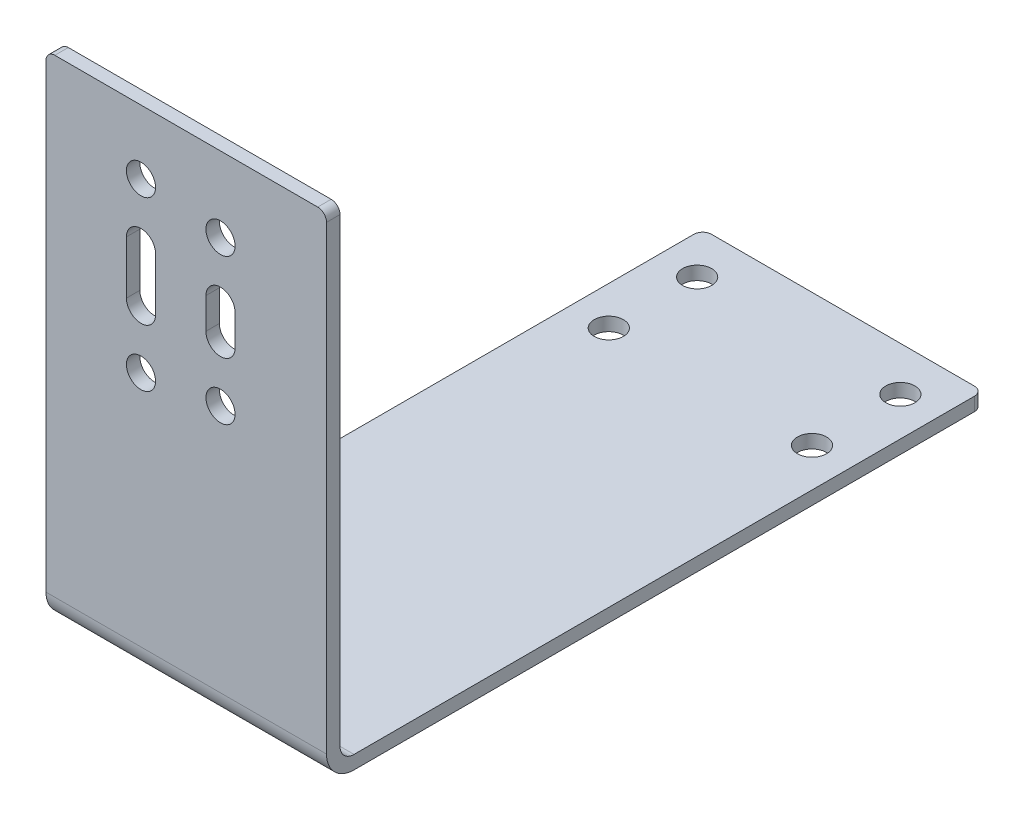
ISO-10303-21;
HEADER;
FILE_DESCRIPTION(('STEP AP214'),'2;1');
FILE_NAME('part.step','',(''),(''),'','','');
FILE_SCHEMA(('AUTOMOTIVE_DESIGN { 1 0 10303 214 1 1 1 1 }'));
ENDSEC;
DATA;
#1=APPLICATION_CONTEXT('core data for automotive mechanical design processes');
#2=APPLICATION_PROTOCOL_DEFINITION('international standard','automotive_design',2000,#1);
#3=PRODUCT_CONTEXT('',#1,'mechanical');
#4=PRODUCT('Part','Part','',(#3));
#5=PRODUCT_RELATED_PRODUCT_CATEGORY('part','',(#4));
#6=PRODUCT_DEFINITION_FORMATION('','',#4);
#7=PRODUCT_DEFINITION_CONTEXT('part definition',#1,'design');
#8=PRODUCT_DEFINITION('design','',#6,#7);
#9=PRODUCT_DEFINITION_SHAPE('','',#8);
#10=(LENGTH_UNIT() NAMED_UNIT(*) SI_UNIT(.MILLI.,.METRE.));
#11=(NAMED_UNIT(*) PLANE_ANGLE_UNIT() SI_UNIT($,.RADIAN.));
#12=(NAMED_UNIT(*) SI_UNIT($,.STERADIAN.) SOLID_ANGLE_UNIT());
#13=UNCERTAINTY_MEASURE_WITH_UNIT(LENGTH_MEASURE(1.E-05),#10,'distance_accuracy_value','');
#14=(GEOMETRIC_REPRESENTATION_CONTEXT(3) GLOBAL_UNCERTAINTY_ASSIGNED_CONTEXT((#13)) GLOBAL_UNIT_ASSIGNED_CONTEXT((#10,
#11,#12)) REPRESENTATION_CONTEXT('',''));
#15=CARTESIAN_POINT('',(0.,0.,0.));
#16=DIRECTION('',(0.,0.,1.));
#17=DIRECTION('',(1.,0.,0.));
#18=AXIS2_PLACEMENT_3D('',#15,#16,#17);
#19=CARTESIAN_POINT('',(0.,3.048,-122.42));
#20=DIRECTION('',(0.,-1.,0.));
#21=DIRECTION('',(0.,0.,-1.));
#22=AXIS2_PLACEMENT_3D('',#19,#20,#21);
#23=PLANE('',#22);
#24=CARTESIAN_POINT('',(54.75,3.048,-112.42));
#25=DIRECTION('',(0.,1.,0.));
#26=DIRECTION('',(0.,0.,1.));
#27=AXIS2_PLACEMENT_3D('',#24,#25,#26);
#28=CIRCLE('',#27,3.3);
#29=CARTESIAN_POINT('',(54.75,3.048,-109.12));
#30=VERTEX_POINT('',#29);
#31=EDGE_CURVE('E399',#30,#30,#28,.T.);
#32=ORIENTED_EDGE('',*,*,#31,.F.);
#33=EDGE_LOOP('',(#32));
#34=FACE_BOUND('',#33,.T.);
#35=CARTESIAN_POINT('',(8.75,3.048,-112.42));
#36=DIRECTION('',(0.,1.,0.));
#37=DIRECTION('',(0.,0.,1.));
#38=AXIS2_PLACEMENT_3D('',#35,#36,#37);
#39=CIRCLE('',#38,3.3);
#40=CARTESIAN_POINT('',(8.75,3.048,-109.12));
#41=VERTEX_POINT('',#40);
#42=EDGE_CURVE('E393',#41,#41,#39,.T.);
#43=ORIENTED_EDGE('',*,*,#42,.F.);
#44=EDGE_LOOP('',(#43));
#45=FACE_BOUND('',#44,.T.);
#46=CARTESIAN_POINT('',(54.75,3.048,-132.42));
#47=DIRECTION('',(0.,1.,0.));
#48=DIRECTION('',(0.,0.,1.));
#49=AXIS2_PLACEMENT_3D('',#46,#47,#48);
#50=CIRCLE('',#49,3.3);
#51=CARTESIAN_POINT('',(54.75,3.048,-129.12));
#52=VERTEX_POINT('',#51);
#53=EDGE_CURVE('E313',#52,#52,#50,.T.);
#54=ORIENTED_EDGE('',*,*,#53,.F.);
#55=EDGE_LOOP('',(#54));
#56=FACE_BOUND('',#55,.T.);
#57=CARTESIAN_POINT('',(8.75,3.048,-132.42));
#58=DIRECTION('',(0.,1.,0.));
#59=DIRECTION('',(0.,0.,1.));
#60=AXIS2_PLACEMENT_3D('',#57,#58,#59);
#61=CIRCLE('',#60,3.3);
#62=CARTESIAN_POINT('',(8.75,3.048,-129.12));
#63=VERTEX_POINT('',#62);
#64=EDGE_CURVE('E304',#63,#63,#61,.T.);
#65=ORIENTED_EDGE('',*,*,#64,.F.);
#66=EDGE_LOOP('',(#65));
#67=FACE_BOUND('',#66,.T.);
#68=DIRECTION('',(1.,0.,0.));
#69=VECTOR('',#68,1.);
#70=CARTESIAN_POINT('',(0.,3.048,0.));
#71=LINE('',#70,#69);
#72=CARTESIAN_POINT('',(0.,3.048,0.));
#73=VERTEX_POINT('',#72);
#74=CARTESIAN_POINT('',(63.5,3.048,0.));
#75=VERTEX_POINT('',#74);
#76=EDGE_CURVE('E216',#73,#75,#71,.T.);
#77=ORIENTED_EDGE('',*,*,#76,.T.);
#78=DIRECTION('',(0.,0.,-1.));
#79=VECTOR('',#78,1.);
#80=CARTESIAN_POINT('',(63.5,3.048,-122.42));
#81=LINE('',#80,#79);
#82=CARTESIAN_POINT('',(63.5,3.048,-140.42));
#83=VERTEX_POINT('',#82);
#84=EDGE_CURVE('E197',#75,#83,#81,.T.);
#85=ORIENTED_EDGE('',*,*,#84,.T.);
#86=CARTESIAN_POINT('',(61.5,3.048,-140.42));
#87=DIRECTION('',(0.,-1.,0.));
#88=DIRECTION('',(0.,0.,-1.));
#89=AXIS2_PLACEMENT_3D('',#86,#87,#88);
#90=CIRCLE('',#89,2.);
#91=CARTESIAN_POINT('',(61.5,3.048,-142.42));
#92=VERTEX_POINT('',#91);
#93=EDGE_CURVE('E275',#83,#92,#90,.F.);
#94=ORIENTED_EDGE('',*,*,#93,.T.);
#95=DIRECTION('',(-1.,0.,0.));
#96=VECTOR('',#95,1.);
#97=CARTESIAN_POINT('',(0.,3.048,-142.42));
#98=LINE('',#97,#96);
#99=CARTESIAN_POINT('',(2.,3.048,-142.42));
#100=VERTEX_POINT('',#99);
#101=EDGE_CURVE('E225',#92,#100,#98,.T.);
#102=ORIENTED_EDGE('',*,*,#101,.T.);
#103=CARTESIAN_POINT('',(2.,3.048,-140.42));
#104=DIRECTION('',(0.,-1.,0.));
#105=DIRECTION('',(0.,0.,-1.));
#106=AXIS2_PLACEMENT_3D('',#103,#104,#105);
#107=CIRCLE('',#106,2.);
#108=CARTESIAN_POINT('',(0.,3.048,-140.42));
#109=VERTEX_POINT('',#108);
#110=EDGE_CURVE('E254',#100,#109,#107,.F.);
#111=ORIENTED_EDGE('',*,*,#110,.T.);
#112=DIRECTION('',(0.,0.,1.));
#113=VECTOR('',#112,1.);
#114=CARTESIAN_POINT('',(0.,3.048,0.));
#115=LINE('',#114,#113);
#116=EDGE_CURVE('E223',#109,#73,#115,.T.);
#117=ORIENTED_EDGE('',*,*,#116,.T.);
#118=EDGE_LOOP('',(#77,#85,#94,#102,#111,#117));
#119=FACE_BOUND('',#118,.T.);
#120=ADVANCED_FACE('F62',(#34,#45,#56,#67,#119),#23,.F.);
#121=CARTESIAN_POINT('',(0.,0.,-122.42));
#122=DIRECTION('',(0.,-1.,0.));
#123=DIRECTION('',(0.,0.,-1.));
#124=AXIS2_PLACEMENT_3D('',#121,#122,#123);
#125=PLANE('',#124);
#126=CARTESIAN_POINT('',(54.75,0.,-112.42));
#127=DIRECTION('',(0.,-1.,0.));
#128=DIRECTION('',(0.,0.,-1.));
#129=AXIS2_PLACEMENT_3D('',#126,#127,#128);
#130=CIRCLE('',#129,3.3);
#131=CARTESIAN_POINT('',(54.75,0.,-115.72));
#132=VERTEX_POINT('',#131);
#133=EDGE_CURVE('E402',#132,#132,#130,.T.);
#134=ORIENTED_EDGE('',*,*,#133,.F.);
#135=EDGE_LOOP('',(#134));
#136=FACE_BOUND('',#135,.T.);
#137=CARTESIAN_POINT('',(8.75,0.,-112.42));
#138=DIRECTION('',(0.,-1.,0.));
#139=DIRECTION('',(0.,0.,-1.));
#140=AXIS2_PLACEMENT_3D('',#137,#138,#139);
#141=CIRCLE('',#140,3.3);
#142=CARTESIAN_POINT('',(8.75,0.,-115.72));
#143=VERTEX_POINT('',#142);
#144=EDGE_CURVE('E396',#143,#143,#141,.T.);
#145=ORIENTED_EDGE('',*,*,#144,.F.);
#146=EDGE_LOOP('',(#145));
#147=FACE_BOUND('',#146,.T.);
#148=CARTESIAN_POINT('',(54.75,0.,-132.42));
#149=DIRECTION('',(0.,-1.,0.));
#150=DIRECTION('',(0.,0.,-1.));
#151=AXIS2_PLACEMENT_3D('',#148,#149,#150);
#152=CIRCLE('',#151,3.3);
#153=CARTESIAN_POINT('',(54.75,0.,-135.72));
#154=VERTEX_POINT('',#153);
#155=EDGE_CURVE('E316',#154,#154,#152,.T.);
#156=ORIENTED_EDGE('',*,*,#155,.F.);
#157=EDGE_LOOP('',(#156));
#158=FACE_BOUND('',#157,.T.);
#159=CARTESIAN_POINT('',(8.75,0.,-132.42));
#160=DIRECTION('',(0.,-1.,0.));
#161=DIRECTION('',(0.,0.,-1.));
#162=AXIS2_PLACEMENT_3D('',#159,#160,#161);
#163=CIRCLE('',#162,3.3);
#164=CARTESIAN_POINT('',(8.75,0.,-135.72));
#165=VERTEX_POINT('',#164);
#166=EDGE_CURVE('E310',#165,#165,#163,.T.);
#167=ORIENTED_EDGE('',*,*,#166,.F.);
#168=EDGE_LOOP('',(#167));
#169=FACE_BOUND('',#168,.T.);
#170=DIRECTION('',(0.,0.,-1.));
#171=VECTOR('',#170,1.);
#172=CARTESIAN_POINT('',(63.5,0.,-122.42));
#173=LINE('',#172,#171);
#174=CARTESIAN_POINT('',(63.5,0.,0.));
#175=VERTEX_POINT('',#174);
#176=CARTESIAN_POINT('',(63.5,0.,-140.42));
#177=VERTEX_POINT('',#176);
#178=EDGE_CURVE('E210',#175,#177,#173,.T.);
#179=ORIENTED_EDGE('',*,*,#178,.F.);
#180=DIRECTION('',(1.,0.,0.));
#181=VECTOR('',#180,1.);
#182=CARTESIAN_POINT('',(0.,0.,0.));
#183=LINE('',#182,#181);
#184=CARTESIAN_POINT('',(0.,0.,0.));
#185=VERTEX_POINT('',#184);
#186=EDGE_CURVE('E236',#185,#175,#183,.T.);
#187=ORIENTED_EDGE('',*,*,#186,.F.);
#188=DIRECTION('',(0.,0.,1.));
#189=VECTOR('',#188,1.);
#190=CARTESIAN_POINT('',(0.,0.,0.));
#191=LINE('',#190,#189);
#192=CARTESIAN_POINT('',(0.,0.,-140.42));
#193=VERTEX_POINT('',#192);
#194=EDGE_CURVE('E234',#193,#185,#191,.T.);
#195=ORIENTED_EDGE('',*,*,#194,.F.);
#196=CARTESIAN_POINT('',(2.,0.,-140.42));
#197=DIRECTION('',(0.,-1.,0.));
#198=DIRECTION('',(0.,0.,-1.));
#199=AXIS2_PLACEMENT_3D('',#196,#197,#198);
#200=CIRCLE('',#199,2.);
#201=CARTESIAN_POINT('',(2.,0.,-142.42));
#202=VERTEX_POINT('',#201);
#203=EDGE_CURVE('E279',#193,#202,#200,.T.);
#204=ORIENTED_EDGE('',*,*,#203,.T.);
#205=DIRECTION('',(-1.,0.,0.));
#206=VECTOR('',#205,1.);
#207=CARTESIAN_POINT('',(0.,0.,-142.42));
#208=LINE('',#207,#206);
#209=CARTESIAN_POINT('',(61.5,0.,-142.42));
#210=VERTEX_POINT('',#209);
#211=EDGE_CURVE('E230',#210,#202,#208,.T.);
#212=ORIENTED_EDGE('',*,*,#211,.F.);
#213=CARTESIAN_POINT('',(61.5,0.,-140.42));
#214=DIRECTION('',(0.,-1.,0.));
#215=DIRECTION('',(0.,0.,-1.));
#216=AXIS2_PLACEMENT_3D('',#213,#214,#215);
#217=CIRCLE('',#216,2.);
#218=EDGE_CURVE('E283',#210,#177,#217,.T.);
#219=ORIENTED_EDGE('',*,*,#218,.T.);
#220=EDGE_LOOP('',(#179,#187,#195,#204,#212,#219));
#221=FACE_BOUND('',#220,.T.);
#222=ADVANCED_FACE('F427',(#136,#147,#158,#169,#221),#125,.T.);
#223=CARTESIAN_POINT('',(63.5,6.22299999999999,0.));
#224=DIRECTION('',(1.,0.,0.));
#225=DIRECTION('',(0.,0.,1.));
#226=AXIS2_PLACEMENT_3D('',#223,#224,#225);
#227=CYLINDRICAL_SURFACE('',#226,6.22299999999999);
#228=ORIENTED_EDGE('',*,*,#186,.T.);
#229=CARTESIAN_POINT('',(63.5,6.22299999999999,0.));
#230=DIRECTION('',(1.,0.,0.));
#231=DIRECTION('',(0.,0.,-1.));
#232=AXIS2_PLACEMENT_3D('',#229,#230,#231);
#233=CIRCLE('',#232,6.22299999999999);
#234=CARTESIAN_POINT('',(63.5,6.22299999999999,6.22299999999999));
#235=VERTEX_POINT('',#234);
#236=EDGE_CURVE('E302',#175,#235,#233,.F.);
#237=ORIENTED_EDGE('',*,*,#236,.T.);
#238=DIRECTION('',(1.,0.,0.));
#239=VECTOR('',#238,1.);
#240=CARTESIAN_POINT('',(0.,6.22299999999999,6.22299999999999));
#241=LINE('',#240,#239);
#242=CARTESIAN_POINT('',(0.,6.22299999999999,6.22299999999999));
#243=VERTEX_POINT('',#242);
#244=EDGE_CURVE('E301',#235,#243,#241,.F.);
#245=ORIENTED_EDGE('',*,*,#244,.T.);
#246=CARTESIAN_POINT('',(0.,6.22299999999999,0.));
#247=DIRECTION('',(1.,0.,0.));
#248=DIRECTION('',(0.,0.,-1.));
#249=AXIS2_PLACEMENT_3D('',#246,#247,#248);
#250=CIRCLE('',#249,6.22299999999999);
#251=EDGE_CURVE('E237',#185,#243,#250,.F.);
#252=ORIENTED_EDGE('',*,*,#251,.F.);
#253=EDGE_LOOP('',(#228,#237,#245,#252));
#254=FACE_BOUND('',#253,.T.);
#255=ADVANCED_FACE('F433',(#254),#227,.T.);
#256=CARTESIAN_POINT('',(63.5,6.22299999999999,0.));
#257=DIRECTION('',(1.,0.,0.));
#258=DIRECTION('',(0.,0.,1.));
#259=AXIS2_PLACEMENT_3D('',#256,#257,#258);
#260=CYLINDRICAL_SURFACE('',#259,3.17499999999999);
#261=CARTESIAN_POINT('',(63.5,6.22299999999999,0.));
#262=DIRECTION('',(1.,0.,0.));
#263=DIRECTION('',(0.,0.,-1.));
#264=AXIS2_PLACEMENT_3D('',#261,#262,#263);
#265=CIRCLE('',#264,3.17499999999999);
#266=CARTESIAN_POINT('',(63.5,6.22299999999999,3.17499999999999));
#267=VERTEX_POINT('',#266);
#268=EDGE_CURVE('E201',#75,#267,#265,.F.);
#269=ORIENTED_EDGE('',*,*,#268,.F.);
#270=ORIENTED_EDGE('',*,*,#76,.F.);
#271=CARTESIAN_POINT('',(0.,6.22299999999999,0.));
#272=DIRECTION('',(1.,0.,0.));
#273=DIRECTION('',(0.,0.,-1.));
#274=AXIS2_PLACEMENT_3D('',#271,#272,#273);
#275=CIRCLE('',#274,3.17499999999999);
#276=CARTESIAN_POINT('',(0.,6.22299999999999,3.17499999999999));
#277=VERTEX_POINT('',#276);
#278=EDGE_CURVE('E249',#73,#277,#275,.F.);
#279=ORIENTED_EDGE('',*,*,#278,.T.);
#280=DIRECTION('',(1.,0.,0.));
#281=VECTOR('',#280,1.);
#282=CARTESIAN_POINT('',(0.,6.22299999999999,3.17499999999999));
#283=LINE('',#282,#281);
#284=EDGE_CURVE('E219',#277,#267,#283,.T.);
#285=ORIENTED_EDGE('',*,*,#284,.T.);
#286=EDGE_LOOP('',(#269,#270,#279,#285));
#287=FACE_BOUND('',#286,.T.);
#288=ADVANCED_FACE('F214',(#287),#260,.F.);
#289=CARTESIAN_POINT('',(0.,110.958,6.22299999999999));
#290=DIRECTION('',(0.,0.,-1.));
#291=DIRECTION('',(-1.,0.,0.));
#292=AXIS2_PLACEMENT_3D('',#289,#290,#291);
#293=PLANE('',#292);
#294=CARTESIAN_POINT('',(21.5,97.958,6.22299999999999));
#295=DIRECTION('',(0.,0.,1.));
#296=DIRECTION('',(1.,0.,0.));
#297=AXIS2_PLACEMENT_3D('',#294,#295,#296);
#298=CIRCLE('',#297,3.3);
#299=CARTESIAN_POINT('',(24.8,97.958,6.22299999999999));
#300=VERTEX_POINT('',#299);
#301=EDGE_CURVE('E387',#300,#300,#298,.T.);
#302=ORIENTED_EDGE('',*,*,#301,.F.);
#303=EDGE_LOOP('',(#302));
#304=FACE_BOUND('',#303,.T.);
#305=CARTESIAN_POINT('',(39.5,95.458,6.22299999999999));
#306=DIRECTION('',(0.,0.,1.));
#307=DIRECTION('',(1.,0.,0.));
#308=AXIS2_PLACEMENT_3D('',#305,#306,#307);
#309=CIRCLE('',#308,3.3);
#310=CARTESIAN_POINT('',(42.8,95.458,6.22299999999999));
#311=VERTEX_POINT('',#310);
#312=EDGE_CURVE('E381',#311,#311,#309,.T.);
#313=ORIENTED_EDGE('',*,*,#312,.F.);
#314=EDGE_LOOP('',(#313));
#315=FACE_BOUND('',#314,.T.);
#316=CARTESIAN_POINT('',(39.5,82.458,6.22299999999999));
#317=DIRECTION('',(0.,0.,1.));
#318=DIRECTION('',(1.,0.,0.));
#319=AXIS2_PLACEMENT_3D('',#316,#317,#318);
#320=CIRCLE('',#319,3.3);
#321=CARTESIAN_POINT('',(42.8,82.458,6.22299999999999));
#322=VERTEX_POINT('',#321);
#323=CARTESIAN_POINT('',(36.2,82.458,6.22299999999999));
#324=VERTEX_POINT('',#323);
#325=EDGE_CURVE('E357',#322,#324,#320,.T.);
#326=ORIENTED_EDGE('',*,*,#325,.F.);
#327=DIRECTION('',(0.,1.,0.));
#328=VECTOR('',#327,1.);
#329=CARTESIAN_POINT('',(42.8,82.458,6.22299999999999));
#330=LINE('',#329,#328);
#331=CARTESIAN_POINT('',(42.8,75.458,6.22299999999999));
#332=VERTEX_POINT('',#331);
#333=EDGE_CURVE('E321',#332,#322,#330,.T.);
#334=ORIENTED_EDGE('',*,*,#333,.F.);
#335=CARTESIAN_POINT('',(39.5,75.458,6.22299999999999));
#336=DIRECTION('',(0.,0.,1.));
#337=DIRECTION('',(1.,0.,0.));
#338=AXIS2_PLACEMENT_3D('',#335,#336,#337);
#339=CIRCLE('',#338,3.3);
#340=CARTESIAN_POINT('',(36.2,75.458,6.22299999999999));
#341=VERTEX_POINT('',#340);
#342=EDGE_CURVE('E375',#341,#332,#339,.T.);
#343=ORIENTED_EDGE('',*,*,#342,.F.);
#344=DIRECTION('',(0.,-1.,0.));
#345=VECTOR('',#344,1.);
#346=CARTESIAN_POINT('',(36.2,82.458,6.22299999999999));
#347=LINE('',#346,#345);
#348=EDGE_CURVE('E319',#324,#341,#347,.T.);
#349=ORIENTED_EDGE('',*,*,#348,.F.);
#350=EDGE_LOOP('',(#326,#334,#343,#349));
#351=FACE_BOUND('',#350,.T.);
#352=CARTESIAN_POINT('',(21.5,84.958,6.22299999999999));
#353=DIRECTION('',(0.,0.,1.));
#354=DIRECTION('',(1.,0.,0.));
#355=AXIS2_PLACEMENT_3D('',#352,#353,#354);
#356=CIRCLE('',#355,3.3);
#357=CARTESIAN_POINT('',(24.8,84.958,6.22299999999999));
#358=VERTEX_POINT('',#357);
#359=CARTESIAN_POINT('',(18.2,84.958,6.22299999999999));
#360=VERTEX_POINT('',#359);
#361=EDGE_CURVE('E363',#358,#360,#356,.T.);
#362=ORIENTED_EDGE('',*,*,#361,.F.);
#363=DIRECTION('',(0.,1.,0.));
#364=VECTOR('',#363,1.);
#365=CARTESIAN_POINT('',(24.8,84.958,6.22299999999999));
#366=LINE('',#365,#364);
#367=CARTESIAN_POINT('',(24.8,72.958,6.22299999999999));
#368=VERTEX_POINT('',#367);
#369=EDGE_CURVE('E334',#368,#358,#366,.T.);
#370=ORIENTED_EDGE('',*,*,#369,.F.);
#371=CARTESIAN_POINT('',(21.5,72.958,6.22299999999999));
#372=DIRECTION('',(0.,0.,1.));
#373=DIRECTION('',(1.,0.,0.));
#374=AXIS2_PLACEMENT_3D('',#371,#372,#373);
#375=CIRCLE('',#374,3.3);
#376=CARTESIAN_POINT('',(18.2,72.958,6.22299999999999));
#377=VERTEX_POINT('',#376);
#378=EDGE_CURVE('E209',#377,#368,#375,.T.);
#379=ORIENTED_EDGE('',*,*,#378,.F.);
#380=DIRECTION('',(0.,-1.,0.));
#381=VECTOR('',#380,1.);
#382=CARTESIAN_POINT('',(18.2,84.958,6.22299999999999));
#383=LINE('',#382,#381);
#384=EDGE_CURVE('E332',#360,#377,#383,.T.);
#385=ORIENTED_EDGE('',*,*,#384,.F.);
#386=EDGE_LOOP('',(#362,#370,#379,#385));
#387=FACE_BOUND('',#386,.T.);
#388=CARTESIAN_POINT('',(39.5,62.458,6.22299999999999));
#389=DIRECTION('',(0.,0.,1.));
#390=DIRECTION('',(1.,0.,0.));
#391=AXIS2_PLACEMENT_3D('',#388,#389,#390);
#392=CIRCLE('',#391,3.3);
#393=CARTESIAN_POINT('',(42.8,62.458,6.22299999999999));
#394=VERTEX_POINT('',#393);
#395=EDGE_CURVE('E351',#394,#394,#392,.T.);
#396=ORIENTED_EDGE('',*,*,#395,.F.);
#397=EDGE_LOOP('',(#396));
#398=FACE_BOUND('',#397,.T.);
#399=CARTESIAN_POINT('',(21.5,59.958,6.22299999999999));
#400=DIRECTION('',(0.,0.,1.));
#401=DIRECTION('',(1.,0.,0.));
#402=AXIS2_PLACEMENT_3D('',#399,#400,#401);
#403=CIRCLE('',#402,3.3);
#404=CARTESIAN_POINT('',(24.8,59.958,6.22299999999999));
#405=VERTEX_POINT('',#404);
#406=EDGE_CURVE('E345',#405,#405,#403,.T.);
#407=ORIENTED_EDGE('',*,*,#406,.F.);
#408=EDGE_LOOP('',(#407));
#409=FACE_BOUND('',#408,.T.);
#410=DIRECTION('',(0.,-1.,0.));
#411=VECTOR('',#410,1.);
#412=CARTESIAN_POINT('',(63.5,110.958,6.22299999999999));
#413=LINE('',#412,#411);
#414=CARTESIAN_POINT('',(63.5,110.458,6.22299999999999));
#415=VERTEX_POINT('',#414);
#416=EDGE_CURVE('E294',#415,#235,#413,.T.);
#417=ORIENTED_EDGE('',*,*,#416,.F.);
#418=CARTESIAN_POINT('',(61.5,110.458,6.22299999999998));
#419=DIRECTION('',(0.,0.,-1.));
#420=DIRECTION('',(-1.,0.,0.));
#421=AXIS2_PLACEMENT_3D('',#418,#419,#420);
#422=CIRCLE('',#421,2.);
#423=CARTESIAN_POINT('',(61.5,112.458,6.22299999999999));
#424=VERTEX_POINT('',#423);
#425=EDGE_CURVE('E84',#415,#424,#422,.F.);
#426=ORIENTED_EDGE('',*,*,#425,.T.);
#427=DIRECTION('',(-1.,0.,0.));
#428=VECTOR('',#427,1.);
#429=CARTESIAN_POINT('',(0.,112.458,6.22299999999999));
#430=LINE('',#429,#428);
#431=CARTESIAN_POINT('',(2.,112.458,6.22299999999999));
#432=VERTEX_POINT('',#431);
#433=EDGE_CURVE('E247',#424,#432,#430,.T.);
#434=ORIENTED_EDGE('',*,*,#433,.T.);
#435=CARTESIAN_POINT('',(2.,110.458,6.22299999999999));
#436=DIRECTION('',(0.,0.,-1.));
#437=DIRECTION('',(-1.,0.,0.));
#438=AXIS2_PLACEMENT_3D('',#435,#436,#437);
#439=CIRCLE('',#438,2.);
#440=CARTESIAN_POINT('',(0.,110.458,6.22299999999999));
#441=VERTEX_POINT('',#440);
#442=EDGE_CURVE('E260',#432,#441,#439,.F.);
#443=ORIENTED_EDGE('',*,*,#442,.T.);
#444=DIRECTION('',(0.,-1.,0.));
#445=VECTOR('',#444,1.);
#446=CARTESIAN_POINT('',(0.,110.958,6.22299999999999));
#447=LINE('',#446,#445);
#448=EDGE_CURVE('E245',#441,#243,#447,.T.);
#449=ORIENTED_EDGE('',*,*,#448,.T.);
#450=ORIENTED_EDGE('',*,*,#244,.F.);
#451=EDGE_LOOP('',(#417,#426,#434,#443,#449,#450));
#452=FACE_BOUND('',#451,.T.);
#453=ADVANCED_FACE('F299',(#304,#315,#351,#387,#398,#409,#452),#293,.F.);
#454=CARTESIAN_POINT('',(0.,110.958,3.17499999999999));
#455=DIRECTION('',(0.,0.,-1.));
#456=DIRECTION('',(-1.,0.,0.));
#457=AXIS2_PLACEMENT_3D('',#454,#455,#456);
#458=PLANE('',#457);
#459=CARTESIAN_POINT('',(21.5,97.958,3.17499999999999));
#460=DIRECTION('',(0.,0.,-1.));
#461=DIRECTION('',(-1.,0.,0.));
#462=AXIS2_PLACEMENT_3D('',#459,#460,#461);
#463=CIRCLE('',#462,3.3);
#464=CARTESIAN_POINT('',(18.2,97.958,3.17499999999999));
#465=VERTEX_POINT('',#464);
#466=EDGE_CURVE('E390',#465,#465,#463,.T.);
#467=ORIENTED_EDGE('',*,*,#466,.F.);
#468=EDGE_LOOP('',(#467));
#469=FACE_BOUND('',#468,.T.);
#470=CARTESIAN_POINT('',(39.5,95.458,3.17499999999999));
#471=DIRECTION('',(0.,0.,-1.));
#472=DIRECTION('',(-1.,0.,0.));
#473=AXIS2_PLACEMENT_3D('',#470,#471,#472);
#474=CIRCLE('',#473,3.3);
#475=CARTESIAN_POINT('',(36.2,95.458,3.17499999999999));
#476=VERTEX_POINT('',#475);
#477=EDGE_CURVE('E384',#476,#476,#474,.T.);
#478=ORIENTED_EDGE('',*,*,#477,.F.);
#479=EDGE_LOOP('',(#478));
#480=FACE_BOUND('',#479,.T.);
#481=CARTESIAN_POINT('',(39.5,62.458,3.17499999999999));
#482=DIRECTION('',(0.,0.,-1.));
#483=DIRECTION('',(-1.,0.,0.));
#484=AXIS2_PLACEMENT_3D('',#481,#482,#483);
#485=CIRCLE('',#484,3.3);
#486=CARTESIAN_POINT('',(36.2,62.458,3.17499999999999));
#487=VERTEX_POINT('',#486);
#488=EDGE_CURVE('E354',#487,#487,#485,.T.);
#489=ORIENTED_EDGE('',*,*,#488,.F.);
#490=EDGE_LOOP('',(#489));
#491=FACE_BOUND('',#490,.T.);
#492=CARTESIAN_POINT('',(21.5,59.958,3.17499999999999));
#493=DIRECTION('',(0.,0.,-1.));
#494=DIRECTION('',(-1.,0.,0.));
#495=AXIS2_PLACEMENT_3D('',#492,#493,#494);
#496=CIRCLE('',#495,3.3);
#497=CARTESIAN_POINT('',(18.2,59.958,3.17499999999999));
#498=VERTEX_POINT('',#497);
#499=EDGE_CURVE('E348',#498,#498,#496,.T.);
#500=ORIENTED_EDGE('',*,*,#499,.F.);
#501=EDGE_LOOP('',(#500));
#502=FACE_BOUND('',#501,.T.);
#503=DIRECTION('',(0.,-1.,0.));
#504=VECTOR('',#503,1.);
#505=CARTESIAN_POINT('',(24.8,110.958,3.17499999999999));
#506=LINE('',#505,#504);
#507=CARTESIAN_POINT('',(24.8,84.958,3.17499999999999));
#508=VERTEX_POINT('',#507);
#509=CARTESIAN_POINT('',(24.8,72.958,3.17499999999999));
#510=VERTEX_POINT('',#509);
#511=EDGE_CURVE('E343',#508,#510,#506,.T.);
#512=ORIENTED_EDGE('',*,*,#511,.F.);
#513=CARTESIAN_POINT('',(21.5,84.958,3.17499999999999));
#514=DIRECTION('',(0.,0.,-1.));
#515=DIRECTION('',(-1.,0.,0.));
#516=AXIS2_PLACEMENT_3D('',#513,#514,#515);
#517=CIRCLE('',#516,3.3);
#518=CARTESIAN_POINT('',(18.2,84.958,3.17499999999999));
#519=VERTEX_POINT('',#518);
#520=EDGE_CURVE('E366',#519,#508,#517,.T.);
#521=ORIENTED_EDGE('',*,*,#520,.F.);
#522=DIRECTION('',(0.,1.,0.));
#523=VECTOR('',#522,1.);
#524=CARTESIAN_POINT('',(18.2,110.958,3.17499999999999));
#525=LINE('',#524,#523);
#526=CARTESIAN_POINT('',(18.2,72.958,3.17499999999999));
#527=VERTEX_POINT('',#526);
#528=EDGE_CURVE('E339',#527,#519,#525,.T.);
#529=ORIENTED_EDGE('',*,*,#528,.F.);
#530=CARTESIAN_POINT('',(21.5,72.958,3.17499999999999));
#531=DIRECTION('',(0.,0.,-1.));
#532=DIRECTION('',(-1.,0.,0.));
#533=AXIS2_PLACEMENT_3D('',#530,#531,#532);
#534=CIRCLE('',#533,3.3);
#535=EDGE_CURVE('E372',#510,#527,#534,.T.);
#536=ORIENTED_EDGE('',*,*,#535,.F.);
#537=EDGE_LOOP('',(#512,#521,#529,#536));
#538=FACE_BOUND('',#537,.T.);
#539=DIRECTION('',(0.,-1.,0.));
#540=VECTOR('',#539,1.);
#541=CARTESIAN_POINT('',(42.8,110.958,3.17499999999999));
#542=LINE('',#541,#540);
#543=CARTESIAN_POINT('',(42.8,82.458,3.17499999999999));
#544=VERTEX_POINT('',#543);
#545=CARTESIAN_POINT('',(42.8,75.458,3.17499999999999));
#546=VERTEX_POINT('',#545);
#547=EDGE_CURVE('E330',#544,#546,#542,.T.);
#548=ORIENTED_EDGE('',*,*,#547,.F.);
#549=CARTESIAN_POINT('',(39.5,82.458,3.17499999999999));
#550=DIRECTION('',(0.,0.,-1.));
#551=DIRECTION('',(-1.,0.,0.));
#552=AXIS2_PLACEMENT_3D('',#549,#550,#551);
#553=CIRCLE('',#552,3.3);
#554=CARTESIAN_POINT('',(36.2,82.458,3.17499999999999));
#555=VERTEX_POINT('',#554);
#556=EDGE_CURVE('E360',#555,#544,#553,.T.);
#557=ORIENTED_EDGE('',*,*,#556,.F.);
#558=DIRECTION('',(0.,1.,0.));
#559=VECTOR('',#558,1.);
#560=CARTESIAN_POINT('',(36.2,110.958,3.17499999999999));
#561=LINE('',#560,#559);
#562=CARTESIAN_POINT('',(36.2,75.458,3.17499999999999));
#563=VERTEX_POINT('',#562);
#564=EDGE_CURVE('E326',#563,#555,#561,.T.);
#565=ORIENTED_EDGE('',*,*,#564,.F.);
#566=CARTESIAN_POINT('',(39.5,75.458,3.17499999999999));
#567=DIRECTION('',(0.,0.,-1.));
#568=DIRECTION('',(-1.,0.,0.));
#569=AXIS2_PLACEMENT_3D('',#566,#567,#568);
#570=CIRCLE('',#569,3.3);
#571=EDGE_CURVE('E378',#546,#563,#570,.T.);
#572=ORIENTED_EDGE('',*,*,#571,.F.);
#573=EDGE_LOOP('',(#548,#557,#565,#572));
#574=FACE_BOUND('',#573,.T.);
#575=DIRECTION('',(-1.,0.,0.));
#576=VECTOR('',#575,1.);
#577=CARTESIAN_POINT('',(0.,112.458,3.17499999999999));
#578=LINE('',#577,#576);
#579=CARTESIAN_POINT('',(61.5,112.458,3.17499999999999));
#580=VERTEX_POINT('',#579);
#581=CARTESIAN_POINT('',(2.,112.458,3.17499999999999));
#582=VERTEX_POINT('',#581);
#583=EDGE_CURVE('E243',#580,#582,#578,.T.);
#584=ORIENTED_EDGE('',*,*,#583,.F.);
#585=CARTESIAN_POINT('',(61.5,110.458,3.17499999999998));
#586=DIRECTION('',(0.,0.,-1.));
#587=DIRECTION('',(-1.,0.,0.));
#588=AXIS2_PLACEMENT_3D('',#585,#586,#587);
#589=CIRCLE('',#588,2.);
#590=CARTESIAN_POINT('',(63.5,110.458,3.17499999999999));
#591=VERTEX_POINT('',#590);
#592=EDGE_CURVE('E15',#580,#591,#589,.T.);
#593=ORIENTED_EDGE('',*,*,#592,.T.);
#594=DIRECTION('',(0.,-1.,0.));
#595=VECTOR('',#594,1.);
#596=CARTESIAN_POINT('',(63.5,110.958,3.17499999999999));
#597=LINE('',#596,#595);
#598=EDGE_CURVE('E220',#591,#267,#597,.T.);
#599=ORIENTED_EDGE('',*,*,#598,.T.);
#600=ORIENTED_EDGE('',*,*,#284,.F.);
#601=DIRECTION('',(0.,1.,0.));
#602=VECTOR('',#601,1.);
#603=CARTESIAN_POINT('',(0.,3.048,3.17499999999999));
#604=LINE('',#603,#602);
#605=CARTESIAN_POINT('',(0.,110.458,3.17499999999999));
#606=VERTEX_POINT('',#605);
#607=EDGE_CURVE('E246',#606,#277,#604,.F.);
#608=ORIENTED_EDGE('',*,*,#607,.F.);
#609=CARTESIAN_POINT('',(2.,110.458,3.17499999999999));
#610=DIRECTION('',(0.,0.,-1.));
#611=DIRECTION('',(-1.,0.,0.));
#612=AXIS2_PLACEMENT_3D('',#609,#610,#611);
#613=CIRCLE('',#612,2.);
#614=EDGE_CURVE('E253',#606,#582,#613,.T.);
#615=ORIENTED_EDGE('',*,*,#614,.T.);
#616=EDGE_LOOP('',(#584,#593,#599,#600,#608,#615));
#617=FACE_BOUND('',#616,.T.);
#618=ADVANCED_FACE('F417',(#469,#480,#491,#502,#538,#574,#617),#458,.T.);
#619=CARTESIAN_POINT('',(0.,112.458,6.22299999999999));
#620=DIRECTION('',(0.,-1.,0.));
#621=DIRECTION('',(0.,0.,-1.));
#622=AXIS2_PLACEMENT_3D('',#619,#620,#621);
#623=PLANE('',#622);
#624=ORIENTED_EDGE('',*,*,#433,.F.);
#625=DIRECTION('',(0.,0.,1.));
#626=VECTOR('',#625,1.);
#627=CARTESIAN_POINT('',(61.5,112.458,6.22299999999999));
#628=LINE('',#627,#626);
#629=EDGE_CURVE('E70',#424,#580,#628,.F.);
#630=ORIENTED_EDGE('',*,*,#629,.T.);
#631=ORIENTED_EDGE('',*,*,#583,.T.);
#632=DIRECTION('',(0.,0.,-1.));
#633=VECTOR('',#632,1.);
#634=CARTESIAN_POINT('',(2.,112.458,6.22299999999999));
#635=LINE('',#634,#633);
#636=EDGE_CURVE('E257',#582,#432,#635,.F.);
#637=ORIENTED_EDGE('',*,*,#636,.T.);
#638=EDGE_LOOP('',(#624,#630,#631,#637));
#639=FACE_BOUND('',#638,.T.);
#640=ADVANCED_FACE('F448',(#639),#623,.F.);
#641=CARTESIAN_POINT('',(39.5,82.458,6.22299999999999));
#642=DIRECTION('',(0.,0.,1.));
#643=DIRECTION('',(1.,0.,0.));
#644=AXIS2_PLACEMENT_3D('',#641,#642,#643);
#645=CYLINDRICAL_SURFACE('',#644,3.3);
#646=DIRECTION('',(0.,0.,1.));
#647=VECTOR('',#646,1.);
#648=CARTESIAN_POINT('',(42.8,82.458,6.22299999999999));
#649=LINE('',#648,#647);
#650=EDGE_CURVE('E270',#322,#544,#649,.F.);
#651=ORIENTED_EDGE('',*,*,#650,.F.);
#652=ORIENTED_EDGE('',*,*,#325,.T.);
#653=DIRECTION('',(0.,0.,1.));
#654=VECTOR('',#653,1.);
#655=CARTESIAN_POINT('',(36.2,82.458,6.22299999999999));
#656=LINE('',#655,#654);
#657=EDGE_CURVE('E267',#324,#555,#656,.F.);
#658=ORIENTED_EDGE('',*,*,#657,.T.);
#659=ORIENTED_EDGE('',*,*,#556,.T.);
#660=EDGE_LOOP('',(#651,#652,#658,#659));
#661=FACE_BOUND('',#660,.T.);
#662=ADVANCED_FACE('F451',(#661),#645,.F.);
#663=CARTESIAN_POINT('',(21.5,84.958,6.22299999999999));
#664=DIRECTION('',(0.,0.,1.));
#665=DIRECTION('',(1.,0.,0.));
#666=AXIS2_PLACEMENT_3D('',#663,#664,#665);
#667=CYLINDRICAL_SURFACE('',#666,3.3);
#668=DIRECTION('',(0.,0.,1.));
#669=VECTOR('',#668,1.);
#670=CARTESIAN_POINT('',(24.8,84.958,6.22299999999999));
#671=LINE('',#670,#669);
#672=EDGE_CURVE('E265',#358,#508,#671,.F.);
#673=ORIENTED_EDGE('',*,*,#672,.F.);
#674=ORIENTED_EDGE('',*,*,#361,.T.);
#675=DIRECTION('',(0.,0.,1.));
#676=VECTOR('',#675,1.);
#677=CARTESIAN_POINT('',(18.2,84.958,6.22299999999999));
#678=LINE('',#677,#676);
#679=EDGE_CURVE('E262',#360,#519,#678,.F.);
#680=ORIENTED_EDGE('',*,*,#679,.T.);
#681=ORIENTED_EDGE('',*,*,#520,.T.);
#682=EDGE_LOOP('',(#673,#674,#680,#681));
#683=FACE_BOUND('',#682,.T.);
#684=ADVANCED_FACE('F446',(#683),#667,.F.);
#685=CARTESIAN_POINT('',(0.,3.048,0.));
#686=DIRECTION('',(1.,0.,0.));
#687=DIRECTION('',(0.,0.,-1.));
#688=AXIS2_PLACEMENT_3D('',#685,#686,#687);
#689=PLANE('',#688);
#690=ORIENTED_EDGE('',*,*,#116,.F.);
#691=DIRECTION('',(0.,-1.,0.));
#692=VECTOR('',#691,1.);
#693=CARTESIAN_POINT('',(0.,3.048,-140.42));
#694=LINE('',#693,#692);
#695=EDGE_CURVE('E242',#109,#193,#694,.T.);
#696=ORIENTED_EDGE('',*,*,#695,.T.);
#697=ORIENTED_EDGE('',*,*,#194,.T.);
#698=DIRECTION('',(0.,-1.,0.));
#699=VECTOR('',#698,1.);
#700=CARTESIAN_POINT('',(0.,3.048,0.));
#701=LINE('',#700,#699);
#702=EDGE_CURVE('E228',#73,#185,#701,.T.);
#703=ORIENTED_EDGE('',*,*,#702,.F.);
#704=EDGE_LOOP('',(#690,#696,#697,#703));
#705=FACE_BOUND('',#704,.T.);
#706=ADVANCED_FACE('F442',(#705),#689,.F.);
#707=CARTESIAN_POINT('',(0.,3.048,-142.42));
#708=DIRECTION('',(0.,0.,1.));
#709=DIRECTION('',(1.,0.,0.));
#710=AXIS2_PLACEMENT_3D('',#707,#708,#709);
#711=PLANE('',#710);
#712=ORIENTED_EDGE('',*,*,#211,.T.);
#713=DIRECTION('',(0.,-1.,0.));
#714=VECTOR('',#713,1.);
#715=CARTESIAN_POINT('',(2.,3.048,-142.42));
#716=LINE('',#715,#714);
#717=EDGE_CURVE('E273',#202,#100,#716,.F.);
#718=ORIENTED_EDGE('',*,*,#717,.T.);
#719=ORIENTED_EDGE('',*,*,#101,.F.);
#720=DIRECTION('',(0.,-1.,0.));
#721=VECTOR('',#720,1.);
#722=CARTESIAN_POINT('',(61.5,3.048,-142.42));
#723=LINE('',#722,#721);
#724=EDGE_CURVE('E276',#92,#210,#723,.T.);
#725=ORIENTED_EDGE('',*,*,#724,.T.);
#726=EDGE_LOOP('',(#712,#718,#719,#725));
#727=FACE_BOUND('',#726,.T.);
#728=ADVANCED_FACE('F445',(#727),#711,.F.);
#729=CARTESIAN_POINT('',(0.,6.22299999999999,0.));
#730=DIRECTION('',(-1.,0.,0.));
#731=DIRECTION('',(0.,0.,1.));
#732=AXIS2_PLACEMENT_3D('',#729,#730,#731);
#733=PLANE('',#732);
#734=DIRECTION('',(0.,0.,-1.));
#735=VECTOR('',#734,1.);
#736=CARTESIAN_POINT('',(0.,6.22299999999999,6.22299999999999));
#737=LINE('',#736,#735);
#738=EDGE_CURVE('E405',#277,#243,#737,.F.);
#739=ORIENTED_EDGE('',*,*,#738,.F.);
#740=ORIENTED_EDGE('',*,*,#278,.F.);
#741=ORIENTED_EDGE('',*,*,#702,.T.);
#742=ORIENTED_EDGE('',*,*,#251,.T.);
#743=EDGE_LOOP('',(#739,#740,#741,#742));
#744=FACE_BOUND('',#743,.T.);
#745=ADVANCED_FACE('F439',(#744),#733,.T.);
#746=CARTESIAN_POINT('',(0.,3.048,6.22299999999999));
#747=DIRECTION('',(1.,0.,0.));
#748=DIRECTION('',(0.,0.,-1.));
#749=AXIS2_PLACEMENT_3D('',#746,#747,#748);
#750=PLANE('',#749);
#751=ORIENTED_EDGE('',*,*,#448,.F.);
#752=DIRECTION('',(0.,0.,-1.));
#753=VECTOR('',#752,1.);
#754=CARTESIAN_POINT('',(0.,110.458,6.22299999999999));
#755=LINE('',#754,#753);
#756=EDGE_CURVE('E250',#441,#606,#755,.T.);
#757=ORIENTED_EDGE('',*,*,#756,.T.);
#758=ORIENTED_EDGE('',*,*,#607,.T.);
#759=ORIENTED_EDGE('',*,*,#738,.T.);
#760=EDGE_LOOP('',(#751,#757,#758,#759));
#761=FACE_BOUND('',#760,.T.);
#762=ADVANCED_FACE('F486',(#761),#750,.F.);
#763=CARTESIAN_POINT('',(54.75,3.048,-112.42));
#764=DIRECTION('',(0.,1.,0.));
#765=DIRECTION('',(0.,0.,1.));
#766=AXIS2_PLACEMENT_3D('',#763,#764,#765);
#767=CYLINDRICAL_SURFACE('',#766,3.3);
#768=ORIENTED_EDGE('',*,*,#133,.T.);
#769=EDGE_LOOP('',(#768));
#770=FACE_BOUND('',#769,.T.);
#771=ORIENTED_EDGE('',*,*,#31,.T.);
#772=EDGE_LOOP('',(#771));
#773=FACE_BOUND('',#772,.T.);
#774=ADVANCED_FACE('F489',(#770,#773),#767,.F.);
#775=CARTESIAN_POINT('',(8.75,3.048,-112.42));
#776=DIRECTION('',(0.,1.,0.));
#777=DIRECTION('',(0.,0.,1.));
#778=AXIS2_PLACEMENT_3D('',#775,#776,#777);
#779=CYLINDRICAL_SURFACE('',#778,3.3);
#780=ORIENTED_EDGE('',*,*,#144,.T.);
#781=EDGE_LOOP('',(#780));
#782=FACE_BOUND('',#781,.T.);
#783=ORIENTED_EDGE('',*,*,#42,.T.);
#784=EDGE_LOOP('',(#783));
#785=FACE_BOUND('',#784,.T.);
#786=ADVANCED_FACE('F495',(#782,#785),#779,.F.);
#787=CARTESIAN_POINT('',(21.5,97.958,6.22299999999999));
#788=DIRECTION('',(0.,0.,1.));
#789=DIRECTION('',(1.,0.,0.));
#790=AXIS2_PLACEMENT_3D('',#787,#788,#789);
#791=CYLINDRICAL_SURFACE('',#790,3.3);
#792=ORIENTED_EDGE('',*,*,#466,.T.);
#793=EDGE_LOOP('',(#792));
#794=FACE_BOUND('',#793,.T.);
#795=ORIENTED_EDGE('',*,*,#301,.T.);
#796=EDGE_LOOP('',(#795));
#797=FACE_BOUND('',#796,.T.);
#798=ADVANCED_FACE('F516',(#794,#797),#791,.F.);
#799=CARTESIAN_POINT('',(39.5,95.458,6.22299999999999));
#800=DIRECTION('',(0.,0.,1.));
#801=DIRECTION('',(1.,0.,0.));
#802=AXIS2_PLACEMENT_3D('',#799,#800,#801);
#803=CYLINDRICAL_SURFACE('',#802,3.3);
#804=ORIENTED_EDGE('',*,*,#477,.T.);
#805=EDGE_LOOP('',(#804));
#806=FACE_BOUND('',#805,.T.);
#807=ORIENTED_EDGE('',*,*,#312,.T.);
#808=EDGE_LOOP('',(#807));
#809=FACE_BOUND('',#808,.T.);
#810=ADVANCED_FACE('F520',(#806,#809),#803,.F.);
#811=CARTESIAN_POINT('',(39.5,75.458,6.22299999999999));
#812=DIRECTION('',(0.,0.,1.));
#813=DIRECTION('',(1.,0.,0.));
#814=AXIS2_PLACEMENT_3D('',#811,#812,#813);
#815=CYLINDRICAL_SURFACE('',#814,3.3);
#816=ORIENTED_EDGE('',*,*,#342,.T.);
#817=DIRECTION('',(0.,0.,1.));
#818=VECTOR('',#817,1.);
#819=CARTESIAN_POINT('',(42.8,75.458,-3.77700000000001));
#820=LINE('',#819,#818);
#821=EDGE_CURVE('E324',#546,#332,#820,.T.);
#822=ORIENTED_EDGE('',*,*,#821,.F.);
#823=ORIENTED_EDGE('',*,*,#571,.T.);
#824=DIRECTION('',(0.,0.,1.));
#825=VECTOR('',#824,1.);
#826=CARTESIAN_POINT('',(36.2,75.458,-3.77700000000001));
#827=LINE('',#826,#825);
#828=EDGE_CURVE('E323',#563,#341,#827,.T.);
#829=ORIENTED_EDGE('',*,*,#828,.T.);
#830=EDGE_LOOP('',(#816,#822,#823,#829));
#831=FACE_BOUND('',#830,.T.);
#832=ADVANCED_FACE('F524',(#831),#815,.F.);
#833=CARTESIAN_POINT('',(21.5,72.958,6.22299999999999));
#834=DIRECTION('',(0.,0.,1.));
#835=DIRECTION('',(1.,0.,0.));
#836=AXIS2_PLACEMENT_3D('',#833,#834,#835);
#837=CYLINDRICAL_SURFACE('',#836,3.3);
#838=ORIENTED_EDGE('',*,*,#378,.T.);
#839=DIRECTION('',(0.,0.,1.));
#840=VECTOR('',#839,1.);
#841=CARTESIAN_POINT('',(24.8,72.958,-3.77700000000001));
#842=LINE('',#841,#840);
#843=EDGE_CURVE('E337',#510,#368,#842,.T.);
#844=ORIENTED_EDGE('',*,*,#843,.F.);
#845=ORIENTED_EDGE('',*,*,#535,.T.);
#846=DIRECTION('',(0.,0.,1.));
#847=VECTOR('',#846,1.);
#848=CARTESIAN_POINT('',(18.2,72.958,-3.77700000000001));
#849=LINE('',#848,#847);
#850=EDGE_CURVE('E336',#527,#377,#849,.T.);
#851=ORIENTED_EDGE('',*,*,#850,.T.);
#852=EDGE_LOOP('',(#838,#844,#845,#851));
#853=FACE_BOUND('',#852,.T.);
#854=ADVANCED_FACE('F528',(#853),#837,.F.);
#855=CARTESIAN_POINT('',(63.5,10.,-122.42));
#856=DIRECTION('',(-1.,0.,0.));
#857=DIRECTION('',(0.,0.,1.));
#858=AXIS2_PLACEMENT_3D('',#855,#856,#857);
#859=PLANE('',#858);
#860=ORIENTED_EDGE('',*,*,#598,.F.);
#861=DIRECTION('',(0.,0.,1.));
#862=VECTOR('',#861,1.);
#863=CARTESIAN_POINT('',(63.5,110.458,-122.42));
#864=LINE('',#863,#862);
#865=EDGE_CURVE('E272',#591,#415,#864,.T.);
#866=ORIENTED_EDGE('',*,*,#865,.T.);
#867=ORIENTED_EDGE('',*,*,#416,.T.);
#868=ORIENTED_EDGE('',*,*,#236,.F.);
#869=ORIENTED_EDGE('',*,*,#178,.T.);
#870=DIRECTION('',(0.,-1.,0.));
#871=VECTOR('',#870,1.);
#872=CARTESIAN_POINT('',(63.5,10.,-140.42));
#873=LINE('',#872,#871);
#874=EDGE_CURVE('E205',#177,#83,#873,.F.);
#875=ORIENTED_EDGE('',*,*,#874,.T.);
#876=ORIENTED_EDGE('',*,*,#84,.F.);
#877=ORIENTED_EDGE('',*,*,#268,.T.);
#878=EDGE_LOOP('',(#860,#866,#867,#868,#869,#875,#876,#877));
#879=FACE_BOUND('',#878,.T.);
#880=ADVANCED_FACE('F200',(#879),#859,.F.);
#881=CARTESIAN_POINT('',(2.,3.048,-140.42));
#882=DIRECTION('',(0.,-1.,0.));
#883=DIRECTION('',(0.,0.,-1.));
#884=AXIS2_PLACEMENT_3D('',#881,#882,#883);
#885=CYLINDRICAL_SURFACE('',#884,2.);
#886=ORIENTED_EDGE('',*,*,#110,.F.);
#887=ORIENTED_EDGE('',*,*,#717,.F.);
#888=ORIENTED_EDGE('',*,*,#203,.F.);
#889=ORIENTED_EDGE('',*,*,#695,.F.);
#890=EDGE_LOOP('',(#886,#887,#888,#889));
#891=FACE_BOUND('',#890,.T.);
#892=ADVANCED_FACE('F456',(#891),#885,.T.);
#893=CARTESIAN_POINT('',(2.,110.458,6.22299999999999));
#894=DIRECTION('',(0.,0.,-1.));
#895=DIRECTION('',(-1.,0.,0.));
#896=AXIS2_PLACEMENT_3D('',#893,#894,#895);
#897=CYLINDRICAL_SURFACE('',#896,2.);
#898=ORIENTED_EDGE('',*,*,#442,.F.);
#899=ORIENTED_EDGE('',*,*,#636,.F.);
#900=ORIENTED_EDGE('',*,*,#614,.F.);
#901=ORIENTED_EDGE('',*,*,#756,.F.);
#902=EDGE_LOOP('',(#898,#899,#900,#901));
#903=FACE_BOUND('',#902,.T.);
#904=ADVANCED_FACE('F452',(#903),#897,.T.);
#905=CARTESIAN_POINT('',(61.5,3.048,-140.42));
#906=DIRECTION('',(0.,-1.,0.));
#907=DIRECTION('',(0.,0.,-1.));
#908=AXIS2_PLACEMENT_3D('',#905,#906,#907);
#909=CYLINDRICAL_SURFACE('',#908,2.);
#910=ORIENTED_EDGE('',*,*,#93,.F.);
#911=ORIENTED_EDGE('',*,*,#874,.F.);
#912=ORIENTED_EDGE('',*,*,#218,.F.);
#913=ORIENTED_EDGE('',*,*,#724,.F.);
#914=EDGE_LOOP('',(#910,#911,#912,#913));
#915=FACE_BOUND('',#914,.T.);
#916=ADVANCED_FACE('F455',(#915),#909,.T.);
#917=CARTESIAN_POINT('',(39.5,62.458,6.22299999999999));
#918=DIRECTION('',(0.,0.,1.));
#919=DIRECTION('',(1.,0.,0.));
#920=AXIS2_PLACEMENT_3D('',#917,#918,#919);
#921=CYLINDRICAL_SURFACE('',#920,3.3);
#922=ORIENTED_EDGE('',*,*,#488,.T.);
#923=EDGE_LOOP('',(#922));
#924=FACE_BOUND('',#923,.T.);
#925=ORIENTED_EDGE('',*,*,#395,.T.);
#926=EDGE_LOOP('',(#925));
#927=FACE_BOUND('',#926,.T.);
#928=ADVANCED_FACE('F464',(#924,#927),#921,.F.);
#929=CARTESIAN_POINT('',(21.5,59.958,6.22299999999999));
#930=DIRECTION('',(0.,0.,1.));
#931=DIRECTION('',(1.,0.,0.));
#932=AXIS2_PLACEMENT_3D('',#929,#930,#931);
#933=CYLINDRICAL_SURFACE('',#932,3.3);
#934=ORIENTED_EDGE('',*,*,#499,.T.);
#935=EDGE_LOOP('',(#934));
#936=FACE_BOUND('',#935,.T.);
#937=ORIENTED_EDGE('',*,*,#406,.T.);
#938=EDGE_LOOP('',(#937));
#939=FACE_BOUND('',#938,.T.);
#940=ADVANCED_FACE('F469',(#936,#939),#933,.F.);
#941=CARTESIAN_POINT('',(18.2,84.958,-3.77700000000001));
#942=DIRECTION('',(-1.,0.,0.));
#943=DIRECTION('',(0.,-1.,0.));
#944=AXIS2_PLACEMENT_3D('',#941,#942,#943);
#945=PLANE('',#944);
#946=ORIENTED_EDGE('',*,*,#528,.T.);
#947=ORIENTED_EDGE('',*,*,#679,.F.);
#948=ORIENTED_EDGE('',*,*,#384,.T.);
#949=ORIENTED_EDGE('',*,*,#850,.F.);
#950=EDGE_LOOP('',(#946,#947,#948,#949));
#951=FACE_BOUND('',#950,.T.);
#952=ADVANCED_FACE('F543',(#951),#945,.F.);
#953=CARTESIAN_POINT('',(24.8,84.958,-3.77700000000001));
#954=DIRECTION('',(1.,0.,0.));
#955=DIRECTION('',(0.,0.,-1.));
#956=AXIS2_PLACEMENT_3D('',#953,#954,#955);
#957=PLANE('',#956);
#958=ORIENTED_EDGE('',*,*,#511,.T.);
#959=ORIENTED_EDGE('',*,*,#843,.T.);
#960=ORIENTED_EDGE('',*,*,#369,.T.);
#961=ORIENTED_EDGE('',*,*,#672,.T.);
#962=EDGE_LOOP('',(#958,#959,#960,#961));
#963=FACE_BOUND('',#962,.T.);
#964=ADVANCED_FACE('F547',(#963),#957,.F.);
#965=CARTESIAN_POINT('',(36.2,82.458,-3.77700000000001));
#966=DIRECTION('',(-1.,0.,0.));
#967=DIRECTION('',(0.,0.,1.));
#968=AXIS2_PLACEMENT_3D('',#965,#966,#967);
#969=PLANE('',#968);
#970=ORIENTED_EDGE('',*,*,#564,.T.);
#971=ORIENTED_EDGE('',*,*,#657,.F.);
#972=ORIENTED_EDGE('',*,*,#348,.T.);
#973=ORIENTED_EDGE('',*,*,#828,.F.);
#974=EDGE_LOOP('',(#970,#971,#972,#973));
#975=FACE_BOUND('',#974,.T.);
#976=ADVANCED_FACE('F551',(#975),#969,.F.);
#977=CARTESIAN_POINT('',(42.8,82.458,-3.77700000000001));
#978=DIRECTION('',(1.,0.,0.));
#979=DIRECTION('',(0.,0.,-1.));
#980=AXIS2_PLACEMENT_3D('',#977,#978,#979);
#981=PLANE('',#980);
#982=ORIENTED_EDGE('',*,*,#547,.T.);
#983=ORIENTED_EDGE('',*,*,#821,.T.);
#984=ORIENTED_EDGE('',*,*,#333,.T.);
#985=ORIENTED_EDGE('',*,*,#650,.T.);
#986=EDGE_LOOP('',(#982,#983,#984,#985));
#987=FACE_BOUND('',#986,.T.);
#988=ADVANCED_FACE('F555',(#987),#981,.F.);
#989=CARTESIAN_POINT('',(54.75,3.048,-132.42));
#990=DIRECTION('',(0.,1.,0.));
#991=DIRECTION('',(0.,0.,1.));
#992=AXIS2_PLACEMENT_3D('',#989,#990,#991);
#993=CYLINDRICAL_SURFACE('',#992,3.3);
#994=ORIENTED_EDGE('',*,*,#155,.T.);
#995=EDGE_LOOP('',(#994));
#996=FACE_BOUND('',#995,.T.);
#997=ORIENTED_EDGE('',*,*,#53,.T.);
#998=EDGE_LOOP('',(#997));
#999=FACE_BOUND('',#998,.T.);
#1000=ADVANCED_FACE('F423',(#996,#999),#993,.F.);
#1001=CARTESIAN_POINT('',(8.75,3.048,-132.42));
#1002=DIRECTION('',(0.,1.,0.));
#1003=DIRECTION('',(0.,0.,1.));
#1004=AXIS2_PLACEMENT_3D('',#1001,#1002,#1003);
#1005=CYLINDRICAL_SURFACE('',#1004,3.3);
#1006=ORIENTED_EDGE('',*,*,#166,.T.);
#1007=EDGE_LOOP('',(#1006));
#1008=FACE_BOUND('',#1007,.T.);
#1009=ORIENTED_EDGE('',*,*,#64,.T.);
#1010=EDGE_LOOP('',(#1009));
#1011=FACE_BOUND('',#1010,.T.);
#1012=ADVANCED_FACE('F419',(#1008,#1011),#1005,.F.);
#1013=CARTESIAN_POINT('',(61.5,110.458,-122.42));
#1014=DIRECTION('',(0.,0.,1.));
#1015=DIRECTION('',(1.,0.,0.));
#1016=AXIS2_PLACEMENT_3D('',#1013,#1014,#1015);
#1017=CYLINDRICAL_SURFACE('',#1016,2.);
#1018=ORIENTED_EDGE('',*,*,#592,.F.);
#1019=ORIENTED_EDGE('',*,*,#629,.F.);
#1020=ORIENTED_EDGE('',*,*,#425,.F.);
#1021=ORIENTED_EDGE('',*,*,#865,.F.);
#1022=EDGE_LOOP('',(#1018,#1019,#1020,#1021));
#1023=FACE_BOUND('',#1022,.T.);
#1024=ADVANCED_FACE('F64',(#1023),#1017,.T.);
#1025=CLOSED_SHELL('',(#120,#222,#255,#288,#453,#618,#640,#662,#684,#706,#728,#745,#762,#774,
#786,#798,#810,#832,#854,#880,#892,#904,#916,#928,#940,#952,#964,#976,#988,#1000,#1012,#1024));
#1026=MANIFOLD_SOLID_BREP('B2',#1025);
#1027=ADVANCED_BREP_SHAPE_REPRESENTATION('',(#18,#1026),#14);
#1028=SHAPE_DEFINITION_REPRESENTATION(#9,#1027);
ENDSEC;
END-ISO-10303-21;
